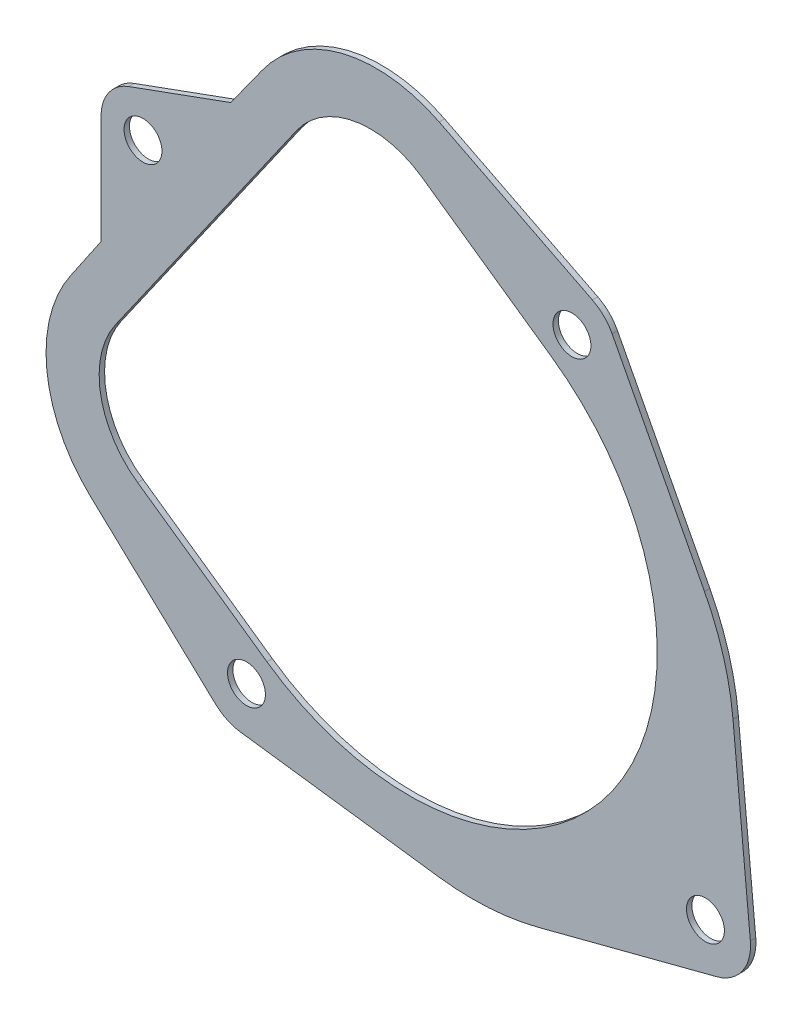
ISO-10303-21;
HEADER;
FILE_DESCRIPTION(('STEP AP214'),'2;1');
FILE_NAME('part.step','',(''),(''),'','','');
FILE_SCHEMA(('AUTOMOTIVE_DESIGN { 1 0 10303 214 1 1 1 1 }'));
ENDSEC;
DATA;
#1=APPLICATION_CONTEXT('core data for automotive mechanical design processes');
#2=APPLICATION_PROTOCOL_DEFINITION('international standard','automotive_design',2000,#1);
#3=PRODUCT_CONTEXT('',#1,'mechanical');
#4=PRODUCT('Part','Part','',(#3));
#5=PRODUCT_RELATED_PRODUCT_CATEGORY('part','',(#4));
#6=PRODUCT_DEFINITION_FORMATION('','',#4);
#7=PRODUCT_DEFINITION_CONTEXT('part definition',#1,'design');
#8=PRODUCT_DEFINITION('design','',#6,#7);
#9=PRODUCT_DEFINITION_SHAPE('','',#8);
#10=(LENGTH_UNIT() NAMED_UNIT(*) SI_UNIT(.MILLI.,.METRE.));
#11=(NAMED_UNIT(*) PLANE_ANGLE_UNIT() SI_UNIT($,.RADIAN.));
#12=(NAMED_UNIT(*) SI_UNIT($,.STERADIAN.) SOLID_ANGLE_UNIT());
#13=UNCERTAINTY_MEASURE_WITH_UNIT(LENGTH_MEASURE(1.E-05),#10,'distance_accuracy_value','');
#14=(GEOMETRIC_REPRESENTATION_CONTEXT(3) GLOBAL_UNCERTAINTY_ASSIGNED_CONTEXT((#13)) GLOBAL_UNIT_ASSIGNED_CONTEXT((#10,
#11,#12)) REPRESENTATION_CONTEXT('',''));
#15=CARTESIAN_POINT('',(0.,0.,0.));
#16=DIRECTION('',(0.,0.,1.));
#17=DIRECTION('',(1.,0.,0.));
#18=AXIS2_PLACEMENT_3D('',#15,#16,#17);
#19=CARTESIAN_POINT('',(-31.7166244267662,17.5170863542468,0.3));
#20=DIRECTION('',(0.,0.,1.));
#21=DIRECTION('',(1.,0.,0.));
#22=AXIS2_PLACEMENT_3D('',#19,#20,#21);
#23=PLANE('',#22);
#24=CARTESIAN_POINT('',(30.6376174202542,-26.1438238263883,0.3));
#25=DIRECTION('',(0.,0.,1.));
#26=DIRECTION('',(1.,0.,0.));
#27=AXIS2_PLACEMENT_3D('',#24,#25,#26);
#28=CIRCLE('',#27,2.1);
#29=CARTESIAN_POINT('',(32.7376174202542,-26.1438238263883,0.3));
#30=VERTEX_POINT('',#29);
#31=EDGE_CURVE('E250',#30,#30,#28,.T.);
#32=ORIENTED_EDGE('',*,*,#31,.F.);
#33=EDGE_LOOP('',(#32));
#34=FACE_BOUND('',#33,.T.);
#35=CARTESIAN_POINT('',(-31.7166244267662,17.5170863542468,0.3));
#36=DIRECTION('',(0.,0.,1.));
#37=DIRECTION('',(1.,0.,0.));
#38=AXIS2_PLACEMENT_3D('',#35,#36,#37);
#39=CIRCLE('',#38,2.1);
#40=CARTESIAN_POINT('',(-29.6166244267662,17.5170863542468,0.3));
#41=VERTEX_POINT('',#40);
#42=EDGE_CURVE('E262',#41,#41,#39,.T.);
#43=ORIENTED_EDGE('',*,*,#42,.F.);
#44=EDGE_LOOP('',(#43));
#45=FACE_BOUND('',#44,.T.);
#46=DIRECTION('',(0.,1.,0.));
#47=VECTOR('',#46,1.);
#48=CARTESIAN_POINT('',(-36.3667741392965,5.46993448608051,0.3));
#49=LINE('',#48,#47);
#50=CARTESIAN_POINT('',(-36.3667741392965,5.46993448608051,0.3));
#51=VERTEX_POINT('',#50);
#52=CARTESIAN_POINT('',(-36.3667741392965,17.5170863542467,0.3));
#53=VERTEX_POINT('',#52);
#54=EDGE_CURVE('E325',#51,#53,#49,.T.);
#55=ORIENTED_EDGE('',*,*,#54,.F.);
#56=DIRECTION('',(0.56326527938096,0.826276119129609,0.));
#57=VECTOR('',#56,1.);
#58=CARTESIAN_POINT('',(-39.6617252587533,0.636440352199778,0.3));
#59=LINE('',#58,#57);
#60=CARTESIAN_POINT('',(-39.6617252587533,0.636440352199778,0.3));
#61=VERTEX_POINT('',#60);
#62=EDGE_CURVE('E376',#61,#51,#59,.T.);
#63=ORIENTED_EDGE('',*,*,#62,.F.);
#64=CARTESIAN_POINT('',(-26.9631728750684,-8.25157221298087,0.3));
#65=DIRECTION('',(0.,0.,1.));
#66=DIRECTION('',(1.,0.,0.));
#67=AXIS2_PLACEMENT_3D('',#64,#65,#66);
#68=CIRCLE('',#67,15.5);
#69=CARTESIAN_POINT('',(-37.5666044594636,-19.5572008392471,0.3));
#70=VERTEX_POINT('',#69);
#71=EDGE_CURVE('E373',#61,#70,#68,.T.);
#72=ORIENTED_EDGE('',*,*,#71,.T.);
#73=DIRECTION('',(0.72939539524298,-0.684092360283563,0.));
#74=VECTOR('',#73,1.);
#75=CARTESIAN_POINT('',(-37.5666044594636,-19.5572008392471,0.3));
#76=LINE('',#75,#74);
#77=CARTESIAN_POINT('',(-23.6826581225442,-32.5788098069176,0.3));
#78=VERTEX_POINT('',#77);
#79=EDGE_CURVE('E370',#70,#78,#76,.T.);
#80=ORIENTED_EDGE('',*,*,#79,.T.);
#81=CARTESIAN_POINT('',(-20.2467719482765,-28.9153870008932,0.3));
#82=DIRECTION('',(0.,0.,-1.));
#83=DIRECTION('',(-1.,0.,0.));
#84=AXIS2_PLACEMENT_3D('',#81,#82,#83);
#85=CIRCLE('',#84,5.02254720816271);
#86=CARTESIAN_POINT('',(-20.907521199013,-33.8942815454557,0.3));
#87=VERTEX_POINT('',#86);
#88=EDGE_CURVE('E367',#87,#78,#85,.T.);
#89=ORIENTED_EDGE('',*,*,#88,.F.);
#90=DIRECTION('',(0.991308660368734,-0.13155660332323,0.));
#91=VECTOR('',#90,1.);
#92=CARTESIAN_POINT('',(-20.907521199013,-33.8942815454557,0.3));
#93=LINE('',#92,#91);
#94=CARTESIAN_POINT('',(1.02816442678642,-36.8053670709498,0.3));
#95=VERTEX_POINT('',#94);
#96=EDGE_CURVE('E364',#87,#95,#93,.T.);
#97=ORIENTED_EDGE('',*,*,#96,.T.);
#98=CARTESIAN_POINT('',(4.84330592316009,-8.05741592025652,0.3));
#99=DIRECTION('',(0.,0.,1.));
#100=DIRECTION('',(1.,0.,0.));
#101=AXIS2_PLACEMENT_3D('',#98,#99,#100);
#102=CIRCLE('',#101,29.);
#103=CARTESIAN_POINT('',(12.1473504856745,-36.1225354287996,0.3));
#104=VERTEX_POINT('',#103);
#105=EDGE_CURVE('E361',#95,#104,#102,.T.);
#106=ORIENTED_EDGE('',*,*,#105,.T.);
#107=DIRECTION('',(-0.967762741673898,-0.251863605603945,0.));
#108=VECTOR('',#107,1.);
#109=CARTESIAN_POINT('',(31.8969354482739,-30.9826375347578,0.3));
#110=LINE('',#109,#108);
#111=CARTESIAN_POINT('',(31.8969354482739,-30.9826375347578,0.3));
#112=VERTEX_POINT('',#111);
#113=EDGE_CURVE('E358',#112,#104,#110,.T.);
#114=ORIENTED_EDGE('',*,*,#113,.F.);
#115=CARTESIAN_POINT('',(30.6376174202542,-26.1438238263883,0.3));
#116=DIRECTION('',(0.,0.,-1.));
#117=DIRECTION('',(-1.,0.,0.));
#118=AXIS2_PLACEMENT_3D('',#115,#116,#117);
#119=CIRCLE('',#118,4.99999999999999);
#120=CARTESIAN_POINT('',(35.6153270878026,-25.6722239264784,0.3));
#121=VERTEX_POINT('',#120);
#122=EDGE_CURVE('E355',#121,#112,#119,.T.);
#123=ORIENTED_EDGE('',*,*,#122,.F.);
#124=DIRECTION('',(-0.0943199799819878,0.995541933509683,0.));
#125=VECTOR('',#124,1.);
#126=CARTESIAN_POINT('',(35.6153270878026,-25.6722239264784,0.3));
#127=LINE('',#126,#125);
#128=CARTESIAN_POINT('',(33.690495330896,-5.35573605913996,0.3));
#129=VERTEX_POINT('',#128);
#130=EDGE_CURVE('E352',#121,#129,#127,.T.);
#131=ORIENTED_EDGE('',*,*,#130,.T.);
#132=CARTESIAN_POINT('',(4.81977925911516,-8.09101547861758,0.3));
#133=DIRECTION('',(0.,0.,-1.));
#134=DIRECTION('',(-1.,0.,0.));
#135=AXIS2_PLACEMENT_3D('',#132,#133,#134);
#136=CIRCLE('',#135,29.);
#137=CARTESIAN_POINT('',(30.529161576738,5.32642320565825,0.3));
#138=VERTEX_POINT('',#137);
#139=EDGE_CURVE('E349',#138,#129,#136,.T.);
#140=ORIENTED_EDGE('',*,*,#139,.F.);
#141=DIRECTION('',(0.462670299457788,-0.886530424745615,0.));
#142=VECTOR('',#141,1.);
#143=CARTESIAN_POINT('',(20.2911896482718,24.9435752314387,0.3));
#144=LINE('',#143,#142);
#145=CARTESIAN_POINT('',(20.2911896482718,24.9435752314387,0.3));
#146=VERTEX_POINT('',#145);
#147=EDGE_CURVE('E346',#146,#138,#144,.T.);
#148=ORIENTED_EDGE('',*,*,#147,.F.);
#149=CARTESIAN_POINT('',(15.8385487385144,22.6197918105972,0.3));
#150=DIRECTION('',(0.,0.,1.));
#151=DIRECTION('',(1.,0.,0.));
#152=AXIS2_PLACEMENT_3D('',#149,#150,#151);
#153=CIRCLE('',#152,5.02254720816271);
#154=CARTESIAN_POINT('',(18.1058978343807,27.1014330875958,0.3));
#155=VERTEX_POINT('',#154);
#156=EDGE_CURVE('E343',#146,#155,#153,.T.);
#157=ORIENTED_EDGE('',*,*,#156,.T.);
#158=DIRECTION('',(0.892304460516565,-0.451434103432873,0.));
#159=VECTOR('',#158,1.);
#160=CARTESIAN_POINT('',(1.12099866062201,35.6944224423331,0.3));
#161=LINE('',#160,#159);
#162=CARTESIAN_POINT('',(1.12099866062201,35.6944224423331,0.3));
#163=VERTEX_POINT('',#162);
#164=EDGE_CURVE('E340',#163,#155,#161,.T.);
#165=ORIENTED_EDGE('',*,*,#164,.F.);
#166=CARTESIAN_POINT('',(-5.87622994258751,21.8637033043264,0.3));
#167=DIRECTION('',(0.,0.,-1.));
#168=DIRECTION('',(-1.,0.,0.));
#169=AXIS2_PLACEMENT_3D('',#166,#167,#168);
#170=CIRCLE('',#169,15.5);
#171=CARTESIAN_POINT('',(-18.5713904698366,30.756559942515,0.3));
#172=VERTEX_POINT('',#171);
#173=EDGE_CURVE('E337',#172,#163,#170,.T.);
#174=ORIENTED_EDGE('',*,*,#173,.F.);
#175=DIRECTION('',(-0.583797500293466,-0.811899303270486,0.));
#176=VECTOR('',#175,1.);
#177=CARTESIAN_POINT('',(-18.5713904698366,30.756559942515,0.3));
#178=LINE('',#177,#176);
#179=CARTESIAN_POINT('',(-21.9864495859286,26.0071663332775,0.3));
#180=VERTEX_POINT('',#179);
#181=EDGE_CURVE('E334',#172,#180,#178,.T.);
#182=ORIENTED_EDGE('',*,*,#181,.T.);
#183=DIRECTION('',(-0.939692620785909,-0.342020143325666,0.));
#184=VECTOR('',#183,1.);
#185=CARTESIAN_POINT('',(-21.9864495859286,26.0071663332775,0.3));
#186=LINE('',#185,#184);
#187=CARTESIAN_POINT('',(-33.3070692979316,21.8867977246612,0.3));
#188=VERTEX_POINT('',#187);
#189=EDGE_CURVE('E331',#180,#188,#186,.T.);
#190=ORIENTED_EDGE('',*,*,#189,.T.);
#191=CARTESIAN_POINT('',(-31.7166244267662,17.5170863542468,0.3));
#192=DIRECTION('',(0.,0.,1.));
#193=DIRECTION('',(1.,0.,0.));
#194=AXIS2_PLACEMENT_3D('',#191,#192,#193);
#195=CIRCLE('',#194,4.65014971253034);
#196=EDGE_CURVE('E328',#188,#53,#195,.T.);
#197=ORIENTED_EDGE('',*,*,#196,.T.);
#198=EDGE_LOOP('',(#55,#63,#72,#80,#89,#97,#106,#114,#123,#131,#140,#148,#157,#165,#174,#182,
#190,#197));
#199=FACE_BOUND('',#198,.T.);
#200=CARTESIAN_POINT('',(15.8385487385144,22.6197918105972,0.3));
#201=DIRECTION('',(0.,0.,1.));
#202=DIRECTION('',(1.,0.,0.));
#203=AXIS2_PLACEMENT_3D('',#200,#201,#202);
#204=CIRCLE('',#203,2.1);
#205=CARTESIAN_POINT('',(17.9385487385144,22.6197918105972,0.3));
#206=VERTEX_POINT('',#205);
#207=EDGE_CURVE('E268',#206,#206,#204,.T.);
#208=ORIENTED_EDGE('',*,*,#207,.F.);
#209=EDGE_LOOP('',(#208));
#210=FACE_BOUND('',#209,.T.);
#211=CARTESIAN_POINT('',(-20.2467719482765,-28.9153870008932,0.3));
#212=DIRECTION('',(0.,0.,1.));
#213=DIRECTION('',(1.,0.,0.));
#214=AXIS2_PLACEMENT_3D('',#211,#212,#213);
#215=CIRCLE('',#214,2.1);
#216=CARTESIAN_POINT('',(-18.1467719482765,-28.9153870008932,0.3));
#217=VERTEX_POINT('',#216);
#218=EDGE_CURVE('E256',#217,#217,#215,.T.);
#219=ORIENTED_EDGE('',*,*,#218,.F.);
#220=EDGE_LOOP('',(#219));
#221=FACE_BOUND('',#220,.T.);
#222=DIRECTION('',(-0.819152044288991,0.573576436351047,0.));
#223=VECTOR('',#222,1.);
#224=CARTESIAN_POINT('',(13.5692403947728,19.3788836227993,0.3));
#225=LINE('',#224,#223);
#226=CARTESIAN_POINT('',(13.5692403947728,19.3788836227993,0.3));
#227=VERTEX_POINT('',#226);
#228=CARTESIAN_POINT('',(-0.765920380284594,29.4164712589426,0.3));
#229=VERTEX_POINT('',#228);
#230=EDGE_CURVE('E227',#227,#229,#225,.T.);
#231=ORIENTED_EDGE('',*,*,#230,.F.);
#232=CARTESIAN_POINT('',(-2.20411160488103,-3.14779759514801,0.3));
#233=DIRECTION('',(0.,0.,1.));
#234=DIRECTION('',(1.,0.,0.));
#235=AXIS2_PLACEMENT_3D('',#232,#233,#234);
#236=CIRCLE('',#235,27.5);
#237=CARTESIAN_POINT('',(-17.9774636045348,-25.6744788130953,0.3));
#238=VERTEX_POINT('',#237);
#239=EDGE_CURVE('E196',#238,#227,#236,.T.);
#240=ORIENTED_EDGE('',*,*,#239,.F.);
#241=DIRECTION('',(-0.819152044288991,0.573576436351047,0.));
#242=VECTOR('',#241,1.);
#243=CARTESIAN_POINT('',(-17.9774636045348,-25.6744788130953,0.3));
#244=LINE('',#243,#242);
#245=CARTESIAN_POINT('',(-32.3126243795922,-15.6368911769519,0.3));
#246=VERTEX_POINT('',#245);
#247=EDGE_CURVE('E236',#238,#246,#244,.T.);
#248=ORIENTED_EDGE('',*,*,#247,.T.);
#249=CARTESIAN_POINT('',(-26.5768600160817,-7.44537073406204,0.3));
#250=DIRECTION('',(0.,0.,-1.));
#251=DIRECTION('',(-1.,0.,0.));
#252=AXIS2_PLACEMENT_3D('',#249,#250,#251);
#253=CIRCLE('',#252,9.99999999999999);
#254=CARTESIAN_POINT('',(-34.7683804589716,-1.70960637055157,0.3));
#255=VERTEX_POINT('',#254);
#256=EDGE_CURVE('E49',#246,#255,#253,.T.);
#257=ORIENTED_EDGE('',*,*,#256,.T.);
#258=DIRECTION('',(0.573576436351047,0.819152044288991,0.));
#259=VECTOR('',#258,1.);
#260=CARTESIAN_POINT('',(-34.7683804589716,-1.70960637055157,0.3));
#261=LINE('',#260,#259);
#262=CARTESIAN_POINT('',(-14.693205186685,26.9607151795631,0.3));
#263=VERTEX_POINT('',#262);
#264=EDGE_CURVE('E232',#255,#263,#261,.T.);
#265=ORIENTED_EDGE('',*,*,#264,.T.);
#266=CARTESIAN_POINT('',(-6.50168474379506,21.2249508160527,0.3));
#267=DIRECTION('',(0.,0.,-1.));
#268=DIRECTION('',(-1.,0.,0.));
#269=AXIS2_PLACEMENT_3D('',#266,#267,#268);
#270=CIRCLE('',#269,10.);
#271=EDGE_CURVE('E229',#263,#229,#270,.T.);
#272=ORIENTED_EDGE('',*,*,#271,.T.);
#273=EDGE_LOOP('',(#231,#240,#248,#257,#265,#272));
#274=FACE_BOUND('',#273,.T.);
#275=ADVANCED_FACE('F34',(#34,#45,#199,#210,#221,#274),#23,.T.);
#276=CARTESIAN_POINT('',(-31.7166244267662,17.5170863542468,-0.3));
#277=DIRECTION('',(0.,0.,1.));
#278=DIRECTION('',(1.,0.,0.));
#279=AXIS2_PLACEMENT_3D('',#276,#277,#278);
#280=PLANE('',#279);
#281=CARTESIAN_POINT('',(30.6376174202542,-26.1438238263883,-0.3));
#282=DIRECTION('',(0.,0.,1.));
#283=DIRECTION('',(1.,0.,0.));
#284=AXIS2_PLACEMENT_3D('',#281,#282,#283);
#285=CIRCLE('',#284,2.1);
#286=CARTESIAN_POINT('',(32.7376174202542,-26.1438238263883,-0.3));
#287=VERTEX_POINT('',#286);
#288=EDGE_CURVE('E200',#287,#287,#285,.T.);
#289=ORIENTED_EDGE('',*,*,#288,.T.);
#290=EDGE_LOOP('',(#289));
#291=FACE_BOUND('',#290,.T.);
#292=CARTESIAN_POINT('',(-31.7166244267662,17.5170863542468,-0.3));
#293=DIRECTION('',(0.,0.,1.));
#294=DIRECTION('',(1.,0.,0.));
#295=AXIS2_PLACEMENT_3D('',#292,#293,#294);
#296=CIRCLE('',#295,2.1);
#297=CARTESIAN_POINT('',(-29.6166244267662,17.5170863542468,-0.3));
#298=VERTEX_POINT('',#297);
#299=EDGE_CURVE('E259',#298,#298,#296,.T.);
#300=ORIENTED_EDGE('',*,*,#299,.T.);
#301=EDGE_LOOP('',(#300));
#302=FACE_BOUND('',#301,.T.);
#303=DIRECTION('',(0.,1.,0.));
#304=VECTOR('',#303,1.);
#305=CARTESIAN_POINT('',(-36.3667741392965,5.46993448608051,-0.3));
#306=LINE('',#305,#304);
#307=CARTESIAN_POINT('',(-36.3667741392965,5.46993448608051,-0.3));
#308=VERTEX_POINT('',#307);
#309=CARTESIAN_POINT('',(-36.3667741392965,17.5170863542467,-0.3));
#310=VERTEX_POINT('',#309);
#311=EDGE_CURVE('E271',#308,#310,#306,.T.);
#312=ORIENTED_EDGE('',*,*,#311,.T.);
#313=CARTESIAN_POINT('',(-31.7166244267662,17.5170863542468,-0.3));
#314=DIRECTION('',(0.,0.,1.));
#315=DIRECTION('',(1.,0.,0.));
#316=AXIS2_PLACEMENT_3D('',#313,#314,#315);
#317=CIRCLE('',#316,4.65014971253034);
#318=CARTESIAN_POINT('',(-33.3070692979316,21.8867977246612,-0.3));
#319=VERTEX_POINT('',#318);
#320=EDGE_CURVE('E274',#319,#310,#317,.T.);
#321=ORIENTED_EDGE('',*,*,#320,.F.);
#322=DIRECTION('',(-0.939692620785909,-0.342020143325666,0.));
#323=VECTOR('',#322,1.);
#324=CARTESIAN_POINT('',(-21.9864495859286,26.0071663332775,-0.3));
#325=LINE('',#324,#323);
#326=CARTESIAN_POINT('',(-21.9864495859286,26.0071663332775,-0.3));
#327=VERTEX_POINT('',#326);
#328=EDGE_CURVE('E277',#327,#319,#325,.T.);
#329=ORIENTED_EDGE('',*,*,#328,.F.);
#330=DIRECTION('',(-0.583797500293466,-0.811899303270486,0.));
#331=VECTOR('',#330,1.);
#332=CARTESIAN_POINT('',(-18.5713904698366,30.756559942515,-0.3));
#333=LINE('',#332,#331);
#334=CARTESIAN_POINT('',(-18.5713904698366,30.756559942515,-0.3));
#335=VERTEX_POINT('',#334);
#336=EDGE_CURVE('E280',#335,#327,#333,.T.);
#337=ORIENTED_EDGE('',*,*,#336,.F.);
#338=CARTESIAN_POINT('',(-5.87622994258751,21.8637033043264,-0.3));
#339=DIRECTION('',(0.,0.,-1.));
#340=DIRECTION('',(-1.,0.,0.));
#341=AXIS2_PLACEMENT_3D('',#338,#339,#340);
#342=CIRCLE('',#341,15.5);
#343=CARTESIAN_POINT('',(1.12099866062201,35.6944224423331,-0.3));
#344=VERTEX_POINT('',#343);
#345=EDGE_CURVE('E283',#335,#344,#342,.T.);
#346=ORIENTED_EDGE('',*,*,#345,.T.);
#347=DIRECTION('',(0.892304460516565,-0.451434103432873,0.));
#348=VECTOR('',#347,1.);
#349=CARTESIAN_POINT('',(1.12099866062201,35.6944224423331,-0.3));
#350=LINE('',#349,#348);
#351=CARTESIAN_POINT('',(18.1058978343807,27.1014330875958,-0.3));
#352=VERTEX_POINT('',#351);
#353=EDGE_CURVE('E286',#344,#352,#350,.T.);
#354=ORIENTED_EDGE('',*,*,#353,.T.);
#355=CARTESIAN_POINT('',(15.8385487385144,22.6197918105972,-0.3));
#356=DIRECTION('',(0.,0.,1.));
#357=DIRECTION('',(1.,0.,0.));
#358=AXIS2_PLACEMENT_3D('',#355,#356,#357);
#359=CIRCLE('',#358,5.02254720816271);
#360=CARTESIAN_POINT('',(20.2911896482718,24.9435752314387,-0.3));
#361=VERTEX_POINT('',#360);
#362=EDGE_CURVE('E289',#361,#352,#359,.T.);
#363=ORIENTED_EDGE('',*,*,#362,.F.);
#364=DIRECTION('',(0.462670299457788,-0.886530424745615,0.));
#365=VECTOR('',#364,1.);
#366=CARTESIAN_POINT('',(20.2911896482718,24.9435752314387,-0.3));
#367=LINE('',#366,#365);
#368=CARTESIAN_POINT('',(30.529161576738,5.32642320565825,-0.3));
#369=VERTEX_POINT('',#368);
#370=EDGE_CURVE('E292',#361,#369,#367,.T.);
#371=ORIENTED_EDGE('',*,*,#370,.T.);
#372=CARTESIAN_POINT('',(4.81977925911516,-8.09101547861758,-0.3));
#373=DIRECTION('',(0.,0.,-1.));
#374=DIRECTION('',(-1.,0.,0.));
#375=AXIS2_PLACEMENT_3D('',#372,#373,#374);
#376=CIRCLE('',#375,29.);
#377=CARTESIAN_POINT('',(33.690495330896,-5.35573605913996,-0.3));
#378=VERTEX_POINT('',#377);
#379=EDGE_CURVE('E295',#369,#378,#376,.T.);
#380=ORIENTED_EDGE('',*,*,#379,.T.);
#381=DIRECTION('',(-0.0943199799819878,0.995541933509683,0.));
#382=VECTOR('',#381,1.);
#383=CARTESIAN_POINT('',(35.6153270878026,-25.6722239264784,-0.3));
#384=LINE('',#383,#382);
#385=CARTESIAN_POINT('',(35.6153270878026,-25.6722239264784,-0.3));
#386=VERTEX_POINT('',#385);
#387=EDGE_CURVE('E298',#386,#378,#384,.T.);
#388=ORIENTED_EDGE('',*,*,#387,.F.);
#389=CARTESIAN_POINT('',(30.6376174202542,-26.1438238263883,-0.3));
#390=DIRECTION('',(0.,0.,-1.));
#391=DIRECTION('',(-1.,0.,0.));
#392=AXIS2_PLACEMENT_3D('',#389,#390,#391);
#393=CIRCLE('',#392,4.99999999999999);
#394=CARTESIAN_POINT('',(31.8969354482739,-30.9826375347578,-0.3));
#395=VERTEX_POINT('',#394);
#396=EDGE_CURVE('E301',#386,#395,#393,.T.);
#397=ORIENTED_EDGE('',*,*,#396,.T.);
#398=DIRECTION('',(-0.967762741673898,-0.251863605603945,0.));
#399=VECTOR('',#398,1.);
#400=CARTESIAN_POINT('',(31.8969354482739,-30.9826375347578,-0.3));
#401=LINE('',#400,#399);
#402=CARTESIAN_POINT('',(12.1473504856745,-36.1225354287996,-0.3));
#403=VERTEX_POINT('',#402);
#404=EDGE_CURVE('E304',#395,#403,#401,.T.);
#405=ORIENTED_EDGE('',*,*,#404,.T.);
#406=CARTESIAN_POINT('',(4.84330592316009,-8.05741592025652,-0.3));
#407=DIRECTION('',(0.,0.,1.));
#408=DIRECTION('',(1.,0.,0.));
#409=AXIS2_PLACEMENT_3D('',#406,#407,#408);
#410=CIRCLE('',#409,29.);
#411=CARTESIAN_POINT('',(1.02816442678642,-36.8053670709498,-0.3));
#412=VERTEX_POINT('',#411);
#413=EDGE_CURVE('E307',#412,#403,#410,.T.);
#414=ORIENTED_EDGE('',*,*,#413,.F.);
#415=DIRECTION('',(0.991308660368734,-0.13155660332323,0.));
#416=VECTOR('',#415,1.);
#417=CARTESIAN_POINT('',(-20.907521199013,-33.8942815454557,-0.3));
#418=LINE('',#417,#416);
#419=CARTESIAN_POINT('',(-20.907521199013,-33.8942815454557,-0.3));
#420=VERTEX_POINT('',#419);
#421=EDGE_CURVE('E310',#420,#412,#418,.T.);
#422=ORIENTED_EDGE('',*,*,#421,.F.);
#423=CARTESIAN_POINT('',(-20.2467719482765,-28.9153870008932,-0.3));
#424=DIRECTION('',(0.,0.,-1.));
#425=DIRECTION('',(-1.,0.,0.));
#426=AXIS2_PLACEMENT_3D('',#423,#424,#425);
#427=CIRCLE('',#426,5.02254720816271);
#428=CARTESIAN_POINT('',(-23.6826581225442,-32.5788098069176,-0.3));
#429=VERTEX_POINT('',#428);
#430=EDGE_CURVE('E313',#420,#429,#427,.T.);
#431=ORIENTED_EDGE('',*,*,#430,.T.);
#432=DIRECTION('',(0.72939539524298,-0.684092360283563,0.));
#433=VECTOR('',#432,1.);
#434=CARTESIAN_POINT('',(-37.5666044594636,-19.5572008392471,-0.3));
#435=LINE('',#434,#433);
#436=CARTESIAN_POINT('',(-37.5666044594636,-19.5572008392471,-0.3));
#437=VERTEX_POINT('',#436);
#438=EDGE_CURVE('E316',#437,#429,#435,.T.);
#439=ORIENTED_EDGE('',*,*,#438,.F.);
#440=CARTESIAN_POINT('',(-26.9631728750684,-8.25157221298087,-0.3));
#441=DIRECTION('',(0.,0.,1.));
#442=DIRECTION('',(1.,0.,0.));
#443=AXIS2_PLACEMENT_3D('',#440,#441,#442);
#444=CIRCLE('',#443,15.5);
#445=CARTESIAN_POINT('',(-39.6617252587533,0.636440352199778,-0.3));
#446=VERTEX_POINT('',#445);
#447=EDGE_CURVE('E319',#446,#437,#444,.T.);
#448=ORIENTED_EDGE('',*,*,#447,.F.);
#449=DIRECTION('',(0.56326527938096,0.826276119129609,0.));
#450=VECTOR('',#449,1.);
#451=CARTESIAN_POINT('',(-39.6617252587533,0.636440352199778,-0.3));
#452=LINE('',#451,#450);
#453=EDGE_CURVE('E322',#446,#308,#452,.T.);
#454=ORIENTED_EDGE('',*,*,#453,.T.);
#455=EDGE_LOOP('',(#312,#321,#329,#337,#346,#354,#363,#371,#380,#388,#397,#405,#414,#422,#431,
#439,#448,#454));
#456=FACE_BOUND('',#455,.T.);
#457=CARTESIAN_POINT('',(15.8385487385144,22.6197918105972,-0.3));
#458=DIRECTION('',(0.,0.,1.));
#459=DIRECTION('',(1.,0.,0.));
#460=AXIS2_PLACEMENT_3D('',#457,#458,#459);
#461=CIRCLE('',#460,2.1);
#462=CARTESIAN_POINT('',(17.9385487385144,22.6197918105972,-0.3));
#463=VERTEX_POINT('',#462);
#464=EDGE_CURVE('E265',#463,#463,#461,.T.);
#465=ORIENTED_EDGE('',*,*,#464,.T.);
#466=EDGE_LOOP('',(#465));
#467=FACE_BOUND('',#466,.T.);
#468=CARTESIAN_POINT('',(-20.2467719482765,-28.9153870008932,-0.3));
#469=DIRECTION('',(0.,0.,1.));
#470=DIRECTION('',(1.,0.,0.));
#471=AXIS2_PLACEMENT_3D('',#468,#469,#470);
#472=CIRCLE('',#471,2.1);
#473=CARTESIAN_POINT('',(-18.1467719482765,-28.9153870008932,-0.3));
#474=VERTEX_POINT('',#473);
#475=EDGE_CURVE('E253',#474,#474,#472,.T.);
#476=ORIENTED_EDGE('',*,*,#475,.T.);
#477=EDGE_LOOP('',(#476));
#478=FACE_BOUND('',#477,.T.);
#479=CARTESIAN_POINT('',(-2.20411160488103,-3.14779759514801,-0.3));
#480=DIRECTION('',(0.,0.,1.));
#481=DIRECTION('',(1.,0.,0.));
#482=AXIS2_PLACEMENT_3D('',#479,#480,#481);
#483=CIRCLE('',#482,27.5);
#484=CARTESIAN_POINT('',(-17.9774636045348,-25.6744788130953,-0.3));
#485=VERTEX_POINT('',#484);
#486=CARTESIAN_POINT('',(13.5692403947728,19.3788836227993,-0.3));
#487=VERTEX_POINT('',#486);
#488=EDGE_CURVE('E57',#485,#487,#483,.T.);
#489=ORIENTED_EDGE('',*,*,#488,.T.);
#490=DIRECTION('',(-0.819152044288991,0.573576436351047,0.));
#491=VECTOR('',#490,1.);
#492=CARTESIAN_POINT('',(13.5692403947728,19.3788836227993,-0.3));
#493=LINE('',#492,#491);
#494=CARTESIAN_POINT('',(-0.765920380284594,29.4164712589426,-0.3));
#495=VERTEX_POINT('',#494);
#496=EDGE_CURVE('E204',#487,#495,#493,.T.);
#497=ORIENTED_EDGE('',*,*,#496,.T.);
#498=CARTESIAN_POINT('',(-6.50168474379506,21.2249508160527,-0.3));
#499=DIRECTION('',(0.,0.,-1.));
#500=DIRECTION('',(-1.,0.,0.));
#501=AXIS2_PLACEMENT_3D('',#498,#499,#500);
#502=CIRCLE('',#501,10.);
#503=CARTESIAN_POINT('',(-14.693205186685,26.9607151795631,-0.3));
#504=VERTEX_POINT('',#503);
#505=EDGE_CURVE('E209',#504,#495,#502,.T.);
#506=ORIENTED_EDGE('',*,*,#505,.F.);
#507=DIRECTION('',(0.573576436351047,0.819152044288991,0.));
#508=VECTOR('',#507,1.);
#509=CARTESIAN_POINT('',(-34.7683804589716,-1.70960637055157,-0.3));
#510=LINE('',#509,#508);
#511=CARTESIAN_POINT('',(-34.7683804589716,-1.70960637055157,-0.3));
#512=VERTEX_POINT('',#511);
#513=EDGE_CURVE('E219',#512,#504,#510,.T.);
#514=ORIENTED_EDGE('',*,*,#513,.F.);
#515=CARTESIAN_POINT('',(-26.5768600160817,-7.44537073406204,-0.3));
#516=DIRECTION('',(0.,0.,-1.));
#517=DIRECTION('',(-1.,0.,0.));
#518=AXIS2_PLACEMENT_3D('',#515,#516,#517);
#519=CIRCLE('',#518,9.99999999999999);
#520=CARTESIAN_POINT('',(-32.3126243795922,-15.6368911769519,-0.3));
#521=VERTEX_POINT('',#520);
#522=EDGE_CURVE('E222',#521,#512,#519,.T.);
#523=ORIENTED_EDGE('',*,*,#522,.F.);
#524=DIRECTION('',(-0.819152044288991,0.573576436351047,0.));
#525=VECTOR('',#524,1.);
#526=CARTESIAN_POINT('',(-17.9774636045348,-25.6744788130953,-0.3));
#527=LINE('',#526,#525);
#528=EDGE_CURVE('E215',#485,#521,#527,.T.);
#529=ORIENTED_EDGE('',*,*,#528,.F.);
#530=EDGE_LOOP('',(#489,#497,#506,#514,#523,#529));
#531=FACE_BOUND('',#530,.T.);
#532=ADVANCED_FACE('F212',(#291,#302,#456,#467,#478,#531),#280,.F.);
#533=CARTESIAN_POINT('',(-36.3667741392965,5.46993448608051,0.3));
#534=DIRECTION('',(-1.,0.,0.));
#535=DIRECTION('',(0.,-1.,0.));
#536=AXIS2_PLACEMENT_3D('',#533,#534,#535);
#537=PLANE('',#536);
#538=DIRECTION('',(0.,0.,-1.));
#539=VECTOR('',#538,1.);
#540=CARTESIAN_POINT('',(-36.3667741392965,5.46993448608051,0.3));
#541=LINE('',#540,#539);
#542=EDGE_CURVE('E11',#51,#308,#541,.T.);
#543=ORIENTED_EDGE('',*,*,#542,.F.);
#544=ORIENTED_EDGE('',*,*,#54,.T.);
#545=DIRECTION('',(0.,0.,-1.));
#546=VECTOR('',#545,1.);
#547=CARTESIAN_POINT('',(-36.3667741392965,17.5170863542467,0.3));
#548=LINE('',#547,#546);
#549=EDGE_CURVE('E379',#53,#310,#548,.T.);
#550=ORIENTED_EDGE('',*,*,#549,.T.);
#551=ORIENTED_EDGE('',*,*,#311,.F.);
#552=EDGE_LOOP('',(#543,#544,#550,#551));
#553=FACE_BOUND('',#552,.T.);
#554=ADVANCED_FACE('F423',(#553),#537,.T.);
#555=CARTESIAN_POINT('',(-39.6617252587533,0.636440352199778,0.3));
#556=DIRECTION('',(-0.826276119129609,0.56326527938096,0.));
#557=DIRECTION('',(-0.56326527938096,-0.82627611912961,0.));
#558=AXIS2_PLACEMENT_3D('',#555,#556,#557);
#559=PLANE('',#558);
#560=DIRECTION('',(0.,0.,-1.));
#561=VECTOR('',#560,1.);
#562=CARTESIAN_POINT('',(-39.6617252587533,0.636440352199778,0.3));
#563=LINE('',#562,#561);
#564=EDGE_CURVE('E42',#61,#446,#563,.T.);
#565=ORIENTED_EDGE('',*,*,#564,.F.);
#566=ORIENTED_EDGE('',*,*,#62,.T.);
#567=ORIENTED_EDGE('',*,*,#542,.T.);
#568=ORIENTED_EDGE('',*,*,#453,.F.);
#569=EDGE_LOOP('',(#565,#566,#567,#568));
#570=FACE_BOUND('',#569,.T.);
#571=ADVANCED_FACE('F36',(#570),#559,.T.);
#572=CARTESIAN_POINT('',(-26.9631728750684,-8.25157221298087,0.3));
#573=DIRECTION('',(0.,0.,-1.));
#574=DIRECTION('',(-1.,0.,0.));
#575=AXIS2_PLACEMENT_3D('',#572,#573,#574);
#576=CYLINDRICAL_SURFACE('',#575,15.5);
#577=DIRECTION('',(0.,0.,-1.));
#578=VECTOR('',#577,1.);
#579=CARTESIAN_POINT('',(-37.5666044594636,-19.5572008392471,0.3));
#580=LINE('',#579,#578);
#581=EDGE_CURVE('E409',#70,#437,#580,.T.);
#582=ORIENTED_EDGE('',*,*,#581,.F.);
#583=ORIENTED_EDGE('',*,*,#71,.F.);
#584=ORIENTED_EDGE('',*,*,#564,.T.);
#585=ORIENTED_EDGE('',*,*,#447,.T.);
#586=EDGE_LOOP('',(#582,#583,#584,#585));
#587=FACE_BOUND('',#586,.T.);
#588=ADVANCED_FACE('F413',(#587),#576,.T.);
#589=CARTESIAN_POINT('',(-37.5666044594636,-19.5572008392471,0.3));
#590=DIRECTION('',(0.684092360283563,0.72939539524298,0.));
#591=DIRECTION('',(-0.72939539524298,0.684092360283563,0.));
#592=AXIS2_PLACEMENT_3D('',#589,#590,#591);
#593=PLANE('',#592);
#594=DIRECTION('',(0.,0.,-1.));
#595=VECTOR('',#594,1.);
#596=CARTESIAN_POINT('',(-23.6826581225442,-32.5788098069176,0.3));
#597=LINE('',#596,#595);
#598=EDGE_CURVE('E407',#78,#429,#597,.T.);
#599=ORIENTED_EDGE('',*,*,#598,.F.);
#600=ORIENTED_EDGE('',*,*,#79,.F.);
#601=ORIENTED_EDGE('',*,*,#581,.T.);
#602=ORIENTED_EDGE('',*,*,#438,.T.);
#603=EDGE_LOOP('',(#599,#600,#601,#602));
#604=FACE_BOUND('',#603,.T.);
#605=ADVANCED_FACE('F481',(#604),#593,.F.);
#606=CARTESIAN_POINT('',(-20.2467719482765,-28.9153870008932,0.3));
#607=DIRECTION('',(0.,0.,-1.));
#608=DIRECTION('',(-1.,0.,0.));
#609=AXIS2_PLACEMENT_3D('',#606,#607,#608);
#610=CYLINDRICAL_SURFACE('',#609,5.02254720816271);
#611=DIRECTION('',(0.,0.,-1.));
#612=VECTOR('',#611,1.);
#613=CARTESIAN_POINT('',(-20.907521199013,-33.8942815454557,0.3));
#614=LINE('',#613,#612);
#615=EDGE_CURVE('E405',#87,#420,#614,.T.);
#616=ORIENTED_EDGE('',*,*,#615,.F.);
#617=ORIENTED_EDGE('',*,*,#88,.T.);
#618=ORIENTED_EDGE('',*,*,#598,.T.);
#619=ORIENTED_EDGE('',*,*,#430,.F.);
#620=EDGE_LOOP('',(#616,#617,#618,#619));
#621=FACE_BOUND('',#620,.T.);
#622=ADVANCED_FACE('F479',(#621),#610,.T.);
#623=CARTESIAN_POINT('',(-20.907521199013,-33.8942815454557,0.3));
#624=DIRECTION('',(0.13155660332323,0.991308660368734,0.));
#625=DIRECTION('',(-0.991308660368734,0.13155660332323,0.));
#626=AXIS2_PLACEMENT_3D('',#623,#624,#625);
#627=PLANE('',#626);
#628=DIRECTION('',(0.,0.,-1.));
#629=VECTOR('',#628,1.);
#630=CARTESIAN_POINT('',(1.02816442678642,-36.8053670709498,0.3));
#631=LINE('',#630,#629);
#632=EDGE_CURVE('E403',#95,#412,#631,.T.);
#633=ORIENTED_EDGE('',*,*,#632,.F.);
#634=ORIENTED_EDGE('',*,*,#96,.F.);
#635=ORIENTED_EDGE('',*,*,#615,.T.);
#636=ORIENTED_EDGE('',*,*,#421,.T.);
#637=EDGE_LOOP('',(#633,#634,#635,#636));
#638=FACE_BOUND('',#637,.T.);
#639=ADVANCED_FACE('F475',(#638),#627,.F.);
#640=CARTESIAN_POINT('',(4.84330592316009,-8.05741592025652,0.3));
#641=DIRECTION('',(0.,0.,-1.));
#642=DIRECTION('',(-1.,0.,0.));
#643=AXIS2_PLACEMENT_3D('',#640,#641,#642);
#644=CYLINDRICAL_SURFACE('',#643,29.);
#645=DIRECTION('',(0.,0.,-1.));
#646=VECTOR('',#645,1.);
#647=CARTESIAN_POINT('',(12.1473504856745,-36.1225354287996,0.3));
#648=LINE('',#647,#646);
#649=EDGE_CURVE('E401',#104,#403,#648,.T.);
#650=ORIENTED_EDGE('',*,*,#649,.F.);
#651=ORIENTED_EDGE('',*,*,#105,.F.);
#652=ORIENTED_EDGE('',*,*,#632,.T.);
#653=ORIENTED_EDGE('',*,*,#413,.T.);
#654=EDGE_LOOP('',(#650,#651,#652,#653));
#655=FACE_BOUND('',#654,.T.);
#656=ADVANCED_FACE('F471',(#655),#644,.T.);
#657=CARTESIAN_POINT('',(31.8969354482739,-30.9826375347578,0.3));
#658=DIRECTION('',(0.251863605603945,-0.967762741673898,0.));
#659=DIRECTION('',(0.967762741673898,0.251863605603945,0.));
#660=AXIS2_PLACEMENT_3D('',#657,#658,#659);
#661=PLANE('',#660);
#662=DIRECTION('',(0.,0.,-1.));
#663=VECTOR('',#662,1.);
#664=CARTESIAN_POINT('',(31.8969354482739,-30.9826375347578,0.3));
#665=LINE('',#664,#663);
#666=EDGE_CURVE('E399',#112,#395,#665,.T.);
#667=ORIENTED_EDGE('',*,*,#666,.F.);
#668=ORIENTED_EDGE('',*,*,#113,.T.);
#669=ORIENTED_EDGE('',*,*,#649,.T.);
#670=ORIENTED_EDGE('',*,*,#404,.F.);
#671=EDGE_LOOP('',(#667,#668,#669,#670));
#672=FACE_BOUND('',#671,.T.);
#673=ADVANCED_FACE('F468',(#672),#661,.T.);
#674=CARTESIAN_POINT('',(30.6376174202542,-26.1438238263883,0.3));
#675=DIRECTION('',(0.,0.,-1.));
#676=DIRECTION('',(-1.,0.,0.));
#677=AXIS2_PLACEMENT_3D('',#674,#675,#676);
#678=CYLINDRICAL_SURFACE('',#677,4.99999999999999);
#679=DIRECTION('',(0.,0.,-1.));
#680=VECTOR('',#679,1.);
#681=CARTESIAN_POINT('',(35.6153270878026,-25.6722239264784,0.3));
#682=LINE('',#681,#680);
#683=EDGE_CURVE('E397',#121,#386,#682,.T.);
#684=ORIENTED_EDGE('',*,*,#683,.F.);
#685=ORIENTED_EDGE('',*,*,#122,.T.);
#686=ORIENTED_EDGE('',*,*,#666,.T.);
#687=ORIENTED_EDGE('',*,*,#396,.F.);
#688=EDGE_LOOP('',(#684,#685,#686,#687));
#689=FACE_BOUND('',#688,.T.);
#690=ADVANCED_FACE('F463',(#689),#678,.T.);
#691=CARTESIAN_POINT('',(35.6153270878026,-25.6722239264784,0.3));
#692=DIRECTION('',(-0.995541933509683,-0.0943199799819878,0.));
#693=DIRECTION('',(0.0943199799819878,-0.995541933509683,0.));
#694=AXIS2_PLACEMENT_3D('',#691,#692,#693);
#695=PLANE('',#694);
#696=DIRECTION('',(0.,0.,-1.));
#697=VECTOR('',#696,1.);
#698=CARTESIAN_POINT('',(33.690495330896,-5.35573605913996,0.3));
#699=LINE('',#698,#697);
#700=EDGE_CURVE('E395',#129,#378,#699,.T.);
#701=ORIENTED_EDGE('',*,*,#700,.F.);
#702=ORIENTED_EDGE('',*,*,#130,.F.);
#703=ORIENTED_EDGE('',*,*,#683,.T.);
#704=ORIENTED_EDGE('',*,*,#387,.T.);
#705=EDGE_LOOP('',(#701,#702,#703,#704));
#706=FACE_BOUND('',#705,.T.);
#707=ADVANCED_FACE('F459',(#706),#695,.F.);
#708=CARTESIAN_POINT('',(4.81977925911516,-8.09101547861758,0.3));
#709=DIRECTION('',(0.,0.,-1.));
#710=DIRECTION('',(-1.,0.,0.));
#711=AXIS2_PLACEMENT_3D('',#708,#709,#710);
#712=CYLINDRICAL_SURFACE('',#711,29.);
#713=DIRECTION('',(0.,0.,-1.));
#714=VECTOR('',#713,1.);
#715=CARTESIAN_POINT('',(30.529161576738,5.32642320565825,0.3));
#716=LINE('',#715,#714);
#717=EDGE_CURVE('E393',#138,#369,#716,.T.);
#718=ORIENTED_EDGE('',*,*,#717,.F.);
#719=ORIENTED_EDGE('',*,*,#139,.T.);
#720=ORIENTED_EDGE('',*,*,#700,.T.);
#721=ORIENTED_EDGE('',*,*,#379,.F.);
#722=EDGE_LOOP('',(#718,#719,#720,#721));
#723=FACE_BOUND('',#722,.T.);
#724=ADVANCED_FACE('F455',(#723),#712,.T.);
#725=CARTESIAN_POINT('',(20.2911896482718,24.9435752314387,0.3));
#726=DIRECTION('',(0.886530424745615,0.462670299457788,0.));
#727=DIRECTION('',(-0.462670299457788,0.886530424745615,0.));
#728=AXIS2_PLACEMENT_3D('',#725,#726,#727);
#729=PLANE('',#728);
#730=DIRECTION('',(0.,0.,-1.));
#731=VECTOR('',#730,1.);
#732=CARTESIAN_POINT('',(20.2911896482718,24.9435752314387,0.3));
#733=LINE('',#732,#731);
#734=EDGE_CURVE('E391',#146,#361,#733,.T.);
#735=ORIENTED_EDGE('',*,*,#734,.F.);
#736=ORIENTED_EDGE('',*,*,#147,.T.);
#737=ORIENTED_EDGE('',*,*,#717,.T.);
#738=ORIENTED_EDGE('',*,*,#370,.F.);
#739=EDGE_LOOP('',(#735,#736,#737,#738));
#740=FACE_BOUND('',#739,.T.);
#741=ADVANCED_FACE('F452',(#740),#729,.T.);
#742=CARTESIAN_POINT('',(15.8385487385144,22.6197918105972,0.3));
#743=DIRECTION('',(0.,0.,-1.));
#744=DIRECTION('',(-1.,0.,0.));
#745=AXIS2_PLACEMENT_3D('',#742,#743,#744);
#746=CYLINDRICAL_SURFACE('',#745,5.02254720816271);
#747=DIRECTION('',(0.,0.,-1.));
#748=VECTOR('',#747,1.);
#749=CARTESIAN_POINT('',(18.1058978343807,27.1014330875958,0.3));
#750=LINE('',#749,#748);
#751=EDGE_CURVE('E389',#155,#352,#750,.T.);
#752=ORIENTED_EDGE('',*,*,#751,.F.);
#753=ORIENTED_EDGE('',*,*,#156,.F.);
#754=ORIENTED_EDGE('',*,*,#734,.T.);
#755=ORIENTED_EDGE('',*,*,#362,.T.);
#756=EDGE_LOOP('',(#752,#753,#754,#755));
#757=FACE_BOUND('',#756,.T.);
#758=ADVANCED_FACE('F447',(#757),#746,.T.);
#759=CARTESIAN_POINT('',(1.12099866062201,35.6944224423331,0.3));
#760=DIRECTION('',(0.451434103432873,0.892304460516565,0.));
#761=DIRECTION('',(-0.892304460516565,0.451434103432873,0.));
#762=AXIS2_PLACEMENT_3D('',#759,#760,#761);
#763=PLANE('',#762);
#764=DIRECTION('',(0.,0.,-1.));
#765=VECTOR('',#764,1.);
#766=CARTESIAN_POINT('',(1.12099866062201,35.6944224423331,0.3));
#767=LINE('',#766,#765);
#768=EDGE_CURVE('E387',#163,#344,#767,.T.);
#769=ORIENTED_EDGE('',*,*,#768,.F.);
#770=ORIENTED_EDGE('',*,*,#164,.T.);
#771=ORIENTED_EDGE('',*,*,#751,.T.);
#772=ORIENTED_EDGE('',*,*,#353,.F.);
#773=EDGE_LOOP('',(#769,#770,#771,#772));
#774=FACE_BOUND('',#773,.T.);
#775=ADVANCED_FACE('F444',(#774),#763,.T.);
#776=CARTESIAN_POINT('',(-5.87622994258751,21.8637033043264,0.3));
#777=DIRECTION('',(0.,0.,-1.));
#778=DIRECTION('',(-1.,0.,0.));
#779=AXIS2_PLACEMENT_3D('',#776,#777,#778);
#780=CYLINDRICAL_SURFACE('',#779,15.5);
#781=DIRECTION('',(0.,0.,-1.));
#782=VECTOR('',#781,1.);
#783=CARTESIAN_POINT('',(-18.5713904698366,30.756559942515,0.3));
#784=LINE('',#783,#782);
#785=EDGE_CURVE('E385',#172,#335,#784,.T.);
#786=ORIENTED_EDGE('',*,*,#785,.F.);
#787=ORIENTED_EDGE('',*,*,#173,.T.);
#788=ORIENTED_EDGE('',*,*,#768,.T.);
#789=ORIENTED_EDGE('',*,*,#345,.F.);
#790=EDGE_LOOP('',(#786,#787,#788,#789));
#791=FACE_BOUND('',#790,.T.);
#792=ADVANCED_FACE('F439',(#791),#780,.T.);
#793=CARTESIAN_POINT('',(-18.5713904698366,30.756559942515,0.3));
#794=DIRECTION('',(0.811899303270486,-0.583797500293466,0.));
#795=DIRECTION('',(0.583797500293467,0.811899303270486,0.));
#796=AXIS2_PLACEMENT_3D('',#793,#794,#795);
#797=PLANE('',#796);
#798=DIRECTION('',(0.,0.,-1.));
#799=VECTOR('',#798,1.);
#800=CARTESIAN_POINT('',(-21.9864495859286,26.0071663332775,0.3));
#801=LINE('',#800,#799);
#802=EDGE_CURVE('E383',#180,#327,#801,.T.);
#803=ORIENTED_EDGE('',*,*,#802,.F.);
#804=ORIENTED_EDGE('',*,*,#181,.F.);
#805=ORIENTED_EDGE('',*,*,#785,.T.);
#806=ORIENTED_EDGE('',*,*,#336,.T.);
#807=EDGE_LOOP('',(#803,#804,#805,#806));
#808=FACE_BOUND('',#807,.T.);
#809=ADVANCED_FACE('F435',(#808),#797,.F.);
#810=CARTESIAN_POINT('',(-21.9864495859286,26.0071663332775,0.3));
#811=DIRECTION('',(0.342020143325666,-0.939692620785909,0.));
#812=DIRECTION('',(0.939692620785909,0.342020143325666,0.));
#813=AXIS2_PLACEMENT_3D('',#810,#811,#812);
#814=PLANE('',#813);
#815=DIRECTION('',(0.,0.,-1.));
#816=VECTOR('',#815,1.);
#817=CARTESIAN_POINT('',(-33.3070692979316,21.8867977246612,0.3));
#818=LINE('',#817,#816);
#819=EDGE_CURVE('E381',#188,#319,#818,.T.);
#820=ORIENTED_EDGE('',*,*,#819,.F.);
#821=ORIENTED_EDGE('',*,*,#189,.F.);
#822=ORIENTED_EDGE('',*,*,#802,.T.);
#823=ORIENTED_EDGE('',*,*,#328,.T.);
#824=EDGE_LOOP('',(#820,#821,#822,#823));
#825=FACE_BOUND('',#824,.T.);
#826=ADVANCED_FACE('F431',(#825),#814,.F.);
#827=CARTESIAN_POINT('',(-31.7166244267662,17.5170863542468,0.3));
#828=DIRECTION('',(0.,0.,-1.));
#829=DIRECTION('',(-1.,0.,0.));
#830=AXIS2_PLACEMENT_3D('',#827,#828,#829);
#831=CYLINDRICAL_SURFACE('',#830,4.65014971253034);
#832=ORIENTED_EDGE('',*,*,#196,.F.);
#833=ORIENTED_EDGE('',*,*,#819,.T.);
#834=ORIENTED_EDGE('',*,*,#320,.T.);
#835=ORIENTED_EDGE('',*,*,#549,.F.);
#836=EDGE_LOOP('',(#832,#833,#834,#835));
#837=FACE_BOUND('',#836,.T.);
#838=ADVANCED_FACE('F428',(#837),#831,.T.);
#839=CARTESIAN_POINT('',(15.8385487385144,22.6197918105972,0.3));
#840=DIRECTION('',(0.,0.,-1.));
#841=DIRECTION('',(-1.,0.,0.));
#842=AXIS2_PLACEMENT_3D('',#839,#840,#841);
#843=CYLINDRICAL_SURFACE('',#842,2.1);
#844=ORIENTED_EDGE('',*,*,#207,.T.);
#845=EDGE_LOOP('',(#844));
#846=FACE_BOUND('',#845,.T.);
#847=ORIENTED_EDGE('',*,*,#464,.F.);
#848=EDGE_LOOP('',(#847));
#849=FACE_BOUND('',#848,.T.);
#850=ADVANCED_FACE('F528',(#846,#849),#843,.F.);
#851=CARTESIAN_POINT('',(-31.7166244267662,17.5170863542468,0.3));
#852=DIRECTION('',(0.,0.,-1.));
#853=DIRECTION('',(-1.,0.,0.));
#854=AXIS2_PLACEMENT_3D('',#851,#852,#853);
#855=CYLINDRICAL_SURFACE('',#854,2.1);
#856=ORIENTED_EDGE('',*,*,#42,.T.);
#857=EDGE_LOOP('',(#856));
#858=FACE_BOUND('',#857,.T.);
#859=ORIENTED_EDGE('',*,*,#299,.F.);
#860=EDGE_LOOP('',(#859));
#861=FACE_BOUND('',#860,.T.);
#862=ADVANCED_FACE('F524',(#858,#861),#855,.F.);
#863=CARTESIAN_POINT('',(-20.2467719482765,-28.9153870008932,0.3));
#864=DIRECTION('',(0.,0.,-1.));
#865=DIRECTION('',(-1.,0.,0.));
#866=AXIS2_PLACEMENT_3D('',#863,#864,#865);
#867=CYLINDRICAL_SURFACE('',#866,2.1);
#868=ORIENTED_EDGE('',*,*,#218,.T.);
#869=EDGE_LOOP('',(#868));
#870=FACE_BOUND('',#869,.T.);
#871=ORIENTED_EDGE('',*,*,#475,.F.);
#872=EDGE_LOOP('',(#871));
#873=FACE_BOUND('',#872,.T.);
#874=ADVANCED_FACE('F520',(#870,#873),#867,.F.);
#875=CARTESIAN_POINT('',(30.6376174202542,-26.1438238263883,0.3));
#876=DIRECTION('',(0.,0.,-1.));
#877=DIRECTION('',(-1.,0.,0.));
#878=AXIS2_PLACEMENT_3D('',#875,#876,#877);
#879=CYLINDRICAL_SURFACE('',#878,2.1);
#880=ORIENTED_EDGE('',*,*,#31,.T.);
#881=EDGE_LOOP('',(#880));
#882=FACE_BOUND('',#881,.T.);
#883=ORIENTED_EDGE('',*,*,#288,.F.);
#884=EDGE_LOOP('',(#883));
#885=FACE_BOUND('',#884,.T.);
#886=ADVANCED_FACE('F517',(#882,#885),#879,.F.);
#887=CARTESIAN_POINT('',(-2.20411160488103,-3.14779759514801,0.3));
#888=DIRECTION('',(0.,0.,-1.));
#889=DIRECTION('',(-1.,0.,0.));
#890=AXIS2_PLACEMENT_3D('',#887,#888,#889);
#891=CYLINDRICAL_SURFACE('',#890,27.5);
#892=DIRECTION('',(0.,0.,-1.));
#893=VECTOR('',#892,1.);
#894=CARTESIAN_POINT('',(13.5692403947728,19.3788836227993,0.3));
#895=LINE('',#894,#893);
#896=EDGE_CURVE('E192',#227,#487,#895,.T.);
#897=ORIENTED_EDGE('',*,*,#896,.T.);
#898=ORIENTED_EDGE('',*,*,#488,.F.);
#899=DIRECTION('',(0.,0.,-1.));
#900=VECTOR('',#899,1.);
#901=CARTESIAN_POINT('',(-17.9774636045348,-25.6744788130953,0.3));
#902=LINE('',#901,#900);
#903=EDGE_CURVE('E239',#238,#485,#902,.T.);
#904=ORIENTED_EDGE('',*,*,#903,.F.);
#905=ORIENTED_EDGE('',*,*,#239,.T.);
#906=EDGE_LOOP('',(#897,#898,#904,#905));
#907=FACE_BOUND('',#906,.T.);
#908=ADVANCED_FACE('F194',(#907),#891,.F.);
#909=CARTESIAN_POINT('',(13.5692403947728,19.3788836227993,0.3));
#910=DIRECTION('',(-0.573576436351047,-0.819152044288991,0.));
#911=DIRECTION('',(0.819152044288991,-0.573576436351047,0.));
#912=AXIS2_PLACEMENT_3D('',#909,#910,#911);
#913=PLANE('',#912);
#914=DIRECTION('',(0.,0.,-1.));
#915=VECTOR('',#914,1.);
#916=CARTESIAN_POINT('',(-0.765920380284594,29.4164712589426,0.3));
#917=LINE('',#916,#915);
#918=EDGE_CURVE('E201',#229,#495,#917,.T.);
#919=ORIENTED_EDGE('',*,*,#918,.T.);
#920=ORIENTED_EDGE('',*,*,#496,.F.);
#921=ORIENTED_EDGE('',*,*,#896,.F.);
#922=ORIENTED_EDGE('',*,*,#230,.T.);
#923=EDGE_LOOP('',(#919,#920,#921,#922));
#924=FACE_BOUND('',#923,.T.);
#925=ADVANCED_FACE('F205',(#924),#913,.T.);
#926=CARTESIAN_POINT('',(-6.50168474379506,21.2249508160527,0.3));
#927=DIRECTION('',(0.,0.,-1.));
#928=DIRECTION('',(-1.,0.,0.));
#929=AXIS2_PLACEMENT_3D('',#926,#927,#928);
#930=CYLINDRICAL_SURFACE('',#929,10.);
#931=DIRECTION('',(0.,0.,-1.));
#932=VECTOR('',#931,1.);
#933=CARTESIAN_POINT('',(-14.693205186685,26.9607151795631,0.3));
#934=LINE('',#933,#932);
#935=EDGE_CURVE('E245',#263,#504,#934,.T.);
#936=ORIENTED_EDGE('',*,*,#935,.T.);
#937=ORIENTED_EDGE('',*,*,#505,.T.);
#938=ORIENTED_EDGE('',*,*,#918,.F.);
#939=ORIENTED_EDGE('',*,*,#271,.F.);
#940=EDGE_LOOP('',(#936,#937,#938,#939));
#941=FACE_BOUND('',#940,.T.);
#942=ADVANCED_FACE('F495',(#941),#930,.F.);
#943=CARTESIAN_POINT('',(-34.7683804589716,-1.70960637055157,0.3));
#944=DIRECTION('',(-0.819152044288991,0.573576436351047,0.));
#945=DIRECTION('',(-0.573576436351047,-0.819152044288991,0.));
#946=AXIS2_PLACEMENT_3D('',#943,#944,#945);
#947=PLANE('',#946);
#948=DIRECTION('',(0.,0.,-1.));
#949=VECTOR('',#948,1.);
#950=CARTESIAN_POINT('',(-34.7683804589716,-1.70960637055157,0.3));
#951=LINE('',#950,#949);
#952=EDGE_CURVE('E243',#255,#512,#951,.T.);
#953=ORIENTED_EDGE('',*,*,#952,.T.);
#954=ORIENTED_EDGE('',*,*,#513,.T.);
#955=ORIENTED_EDGE('',*,*,#935,.F.);
#956=ORIENTED_EDGE('',*,*,#264,.F.);
#957=EDGE_LOOP('',(#953,#954,#955,#956));
#958=FACE_BOUND('',#957,.T.);
#959=ADVANCED_FACE('F498',(#958),#947,.F.);
#960=CARTESIAN_POINT('',(-26.5768600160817,-7.44537073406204,0.3));
#961=DIRECTION('',(0.,0.,-1.));
#962=DIRECTION('',(-1.,0.,0.));
#963=AXIS2_PLACEMENT_3D('',#960,#961,#962);
#964=CYLINDRICAL_SURFACE('',#963,9.99999999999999);
#965=DIRECTION('',(0.,0.,-1.));
#966=VECTOR('',#965,1.);
#967=CARTESIAN_POINT('',(-32.3126243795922,-15.6368911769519,0.3));
#968=LINE('',#967,#966);
#969=EDGE_CURVE('E241',#246,#521,#968,.T.);
#970=ORIENTED_EDGE('',*,*,#969,.T.);
#971=ORIENTED_EDGE('',*,*,#522,.T.);
#972=ORIENTED_EDGE('',*,*,#952,.F.);
#973=ORIENTED_EDGE('',*,*,#256,.F.);
#974=EDGE_LOOP('',(#970,#971,#972,#973));
#975=FACE_BOUND('',#974,.T.);
#976=ADVANCED_FACE('F499',(#975),#964,.F.);
#977=CARTESIAN_POINT('',(-17.9774636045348,-25.6744788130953,0.3));
#978=DIRECTION('',(-0.573576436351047,-0.819152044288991,0.));
#979=DIRECTION('',(0.819152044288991,-0.573576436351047,0.));
#980=AXIS2_PLACEMENT_3D('',#977,#978,#979);
#981=PLANE('',#980);
#982=ORIENTED_EDGE('',*,*,#247,.F.);
#983=ORIENTED_EDGE('',*,*,#903,.T.);
#984=ORIENTED_EDGE('',*,*,#528,.T.);
#985=ORIENTED_EDGE('',*,*,#969,.F.);
#986=EDGE_LOOP('',(#982,#983,#984,#985));
#987=FACE_BOUND('',#986,.T.);
#988=ADVANCED_FACE('F502',(#987),#981,.F.);
#989=CLOSED_SHELL('',(#275,#532,#554,#571,#588,#605,#622,#639,#656,#673,#690,#707,#724,#741,
#758,#775,#792,#809,#826,#838,#850,#862,#874,#886,#908,#925,#942,#959,#976,#988));
#990=MANIFOLD_SOLID_BREP('B2',#989);
#991=ADVANCED_BREP_SHAPE_REPRESENTATION('',(#18,#990),#14);
#992=SHAPE_DEFINITION_REPRESENTATION(#9,#991);
ENDSEC;
END-ISO-10303-21;
